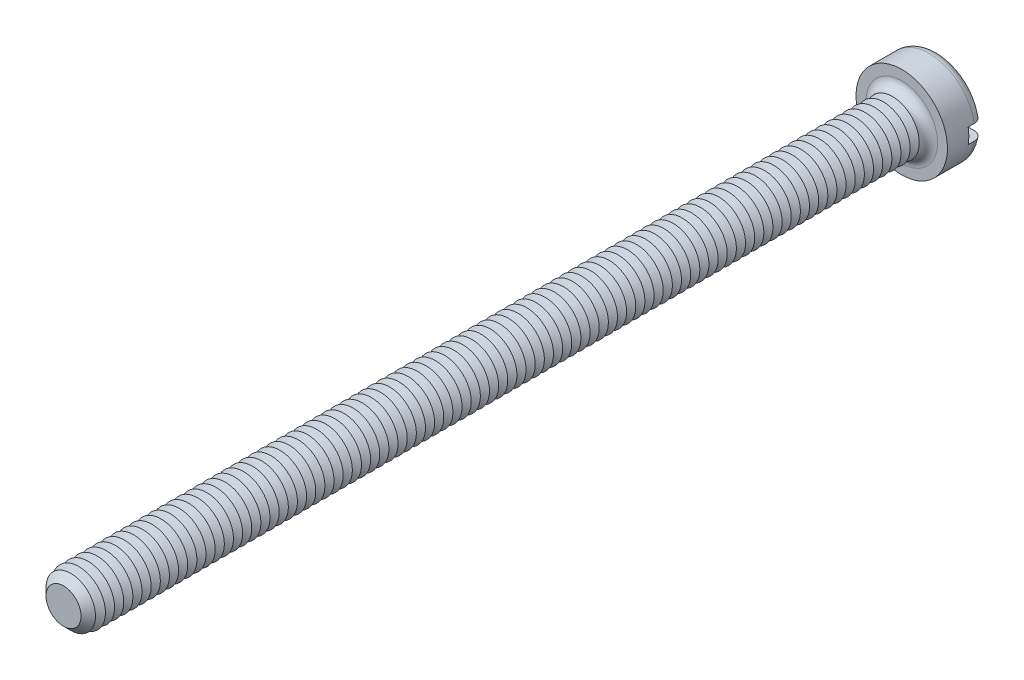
from build123d import *

# Parameters (mm, degrees)
SKETCH3_R           = 3
BOSS_EXTRUDE2_DEPTH = 2.4
SKETCH4_R           = 1.75
BOSS_EXTRUDE3_DEPTH = 55
FILLET1_R           = 0.6
CHAMFER1_SIZE       = 0.6
LPATTERN1_COUNT     = 90
LPATTERN1_PITCH     = 0.6
SKETCH8_W           = 6
SKETCH8_H           = 1
CUT_EXTRUDE1_DEPTH  = 1


with BuildPart() as part:
    # Sketch3 → Boss-Extrude2 (new body)
    with BuildSketch(Plane.XY):
        Circle(SKETCH3_R)
    extrude(amount=-BOSS_EXTRUDE2_DEPTH)

    # Sketch4 → Boss-Extrude3 (add)
    with BuildSketch(Plane.XY):
        Circle(SKETCH4_R)
    extrude(amount=BOSS_EXTRUDE3_DEPTH)

    # Fillet1
    fillet1_edges = [part.edges().sort_by_distance(p)[0] for p in [
        (-3, 0, -2.4),
        (-1.75, 0, 0),
    ]]
    fillet(fillet1_edges, radius=FILLET1_R)

    # Chamfer1
    chamfer1_edges = [part.edges().sort_by_distance(p)[0] for p in [
        (-1.75, 0, 55),
    ]]
    chamfer(chamfer1_edges, length=CHAMFER1_SIZE)

    # Sketch6 → Cut-Revolve1 (revolve, cut)
    with BuildSketch(Plane(origin=(0, 0, 0), x_dir=(0, 0, -1), z_dir=(1, 0, 0)), mode=Mode.PRIVATE) as cut_revolve1_sk:
        Polygon((-0.6, 1.75), (-0.9, 1.230384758), (-1.2, 1.75), align=None)
    cut_revolve1 = revolve(cut_revolve1_sk.sketch.rotate(Axis((0, 0, -1.694361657), (0, 0, 1)), 90), axis=Axis((0, 0, -1.694361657), (0, 0, 1)), mode=Mode.SUBTRACT)

    # LPattern1: Cut-Revolve1 ×90
    with Locations(*[(0, 0, i * LPATTERN1_PITCH) for i in range(1, LPATTERN1_COUNT)]):
        add(cut_revolve1, mode=Mode.SUBTRACT)

    # Sketch8 → Cut-Extrude1 (cut)
    with BuildSketch(Plane(origin=(0, 0, -2.4), x_dir=(-1, 0, 0), z_dir=(0, 0, -1))):
        Rectangle(SKETCH8_W, SKETCH8_H)
    extrude(amount=-CUT_EXTRUDE1_DEPTH, mode=Mode.SUBTRACT)


solid = part.part
